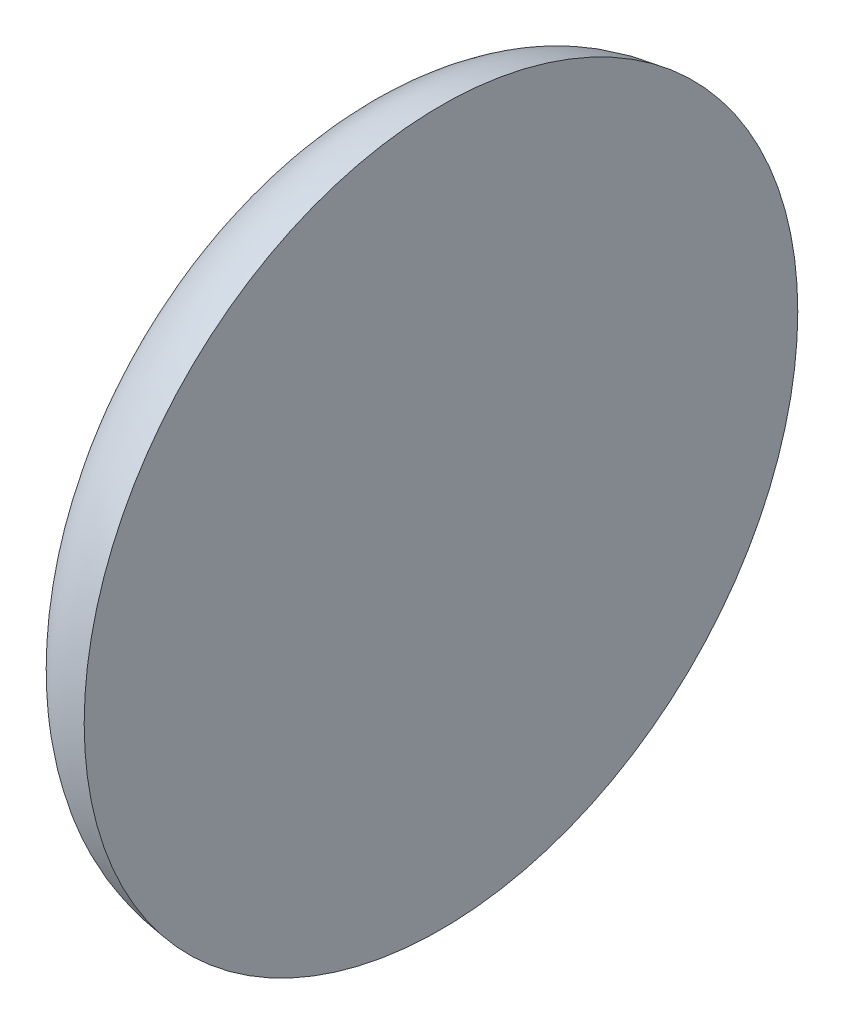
ISO-10303-21;
HEADER;
FILE_DESCRIPTION(('STEP AP214'),'2;1');
FILE_NAME('part.step','',(''),(''),'','','');
FILE_SCHEMA(('AUTOMOTIVE_DESIGN { 1 0 10303 214 1 1 1 1 }'));
ENDSEC;
DATA;
#1=APPLICATION_CONTEXT('core data for automotive mechanical design processes');
#2=APPLICATION_PROTOCOL_DEFINITION('international standard','automotive_design',2000,#1);
#3=PRODUCT_CONTEXT('',#1,'mechanical');
#4=PRODUCT('Part','Part','',(#3));
#5=PRODUCT_RELATED_PRODUCT_CATEGORY('part','',(#4));
#6=PRODUCT_DEFINITION_FORMATION('','',#4);
#7=PRODUCT_DEFINITION_CONTEXT('part definition',#1,'design');
#8=PRODUCT_DEFINITION('design','',#6,#7);
#9=PRODUCT_DEFINITION_SHAPE('','',#8);
#10=(LENGTH_UNIT() NAMED_UNIT(*) SI_UNIT(.MILLI.,.METRE.));
#11=(NAMED_UNIT(*) PLANE_ANGLE_UNIT() SI_UNIT($,.RADIAN.));
#12=(NAMED_UNIT(*) SI_UNIT($,.STERADIAN.) SOLID_ANGLE_UNIT());
#13=UNCERTAINTY_MEASURE_WITH_UNIT(LENGTH_MEASURE(1.E-05),#10,'distance_accuracy_value','');
#14=(GEOMETRIC_REPRESENTATION_CONTEXT(3) GLOBAL_UNCERTAINTY_ASSIGNED_CONTEXT((#13)) GLOBAL_UNIT_ASSIGNED_CONTEXT((#10,
#11,#12)) REPRESENTATION_CONTEXT('',''));
#15=CARTESIAN_POINT('',(0.,0.,0.));
#16=DIRECTION('',(0.,0.,1.));
#17=DIRECTION('',(1.,0.,0.));
#18=AXIS2_PLACEMENT_3D('',#15,#16,#17);
#19=CARTESIAN_POINT('',(5.,0.,-3.));
#20=DIRECTION('',(1.,0.,0.));
#21=DIRECTION('',(0.,0.,-1.));
#22=AXIS2_PLACEMENT_3D('',#19,#20,#21);
#23=PLANE('',#22);
#24=CARTESIAN_POINT('',(5.,0.,0.));
#25=DIRECTION('',(-1.,0.,0.));
#26=DIRECTION('',(0.,0.,1.));
#27=AXIS2_PLACEMENT_3D('',#24,#25,#26);
#28=CIRCLE('',#27,3.);
#29=CARTESIAN_POINT('',(5.,0.,3.));
#30=VERTEX_POINT('',#29);
#31=EDGE_CURVE('E11',#30,#30,#28,.T.);
#32=ORIENTED_EDGE('',*,*,#31,.T.);
#33=EDGE_LOOP('',(#32));
#34=FACE_BOUND('',#33,.T.);
#35=ADVANCED_FACE('F30',(#34),#23,.F.);
#36=CARTESIAN_POINT('',(7.,0.,-6.));
#37=CARTESIAN_POINT('',(6.78088206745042,0.,-5.97176480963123));
#38=CARTESIAN_POINT('',(6.33036741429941,0.,-5.91371220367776));
#39=CARTESIAN_POINT('',(5.83765907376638,0.,-5.51496590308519));
#40=CARTESIAN_POINT('',(5.4581772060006,0.,-4.97345080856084));
#41=CARTESIAN_POINT('',(5.10440247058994,0.,-4.16021298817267));
#42=CARTESIAN_POINT('',(5.03983360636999,0.,-3.44266641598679));
#43=CARTESIAN_POINT('',(5.,0.,-3.));
#44=B_SPLINE_CURVE_WITH_KNOTS('',3,(#36,#37,#38,#39,#40,#41,#42,#43),.UNSPECIFIED.,.F.,.F.,(4,1,
1,1,1,4),(0.,0.164642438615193,0.338511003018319,0.458080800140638,0.665681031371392,1.),.UNSPECIFIED.);
#45=CARTESIAN_POINT('',(0.,0.,0.));
#46=DIRECTION('',(-1.,0.,0.));
#47=AXIS1_PLACEMENT('',#45,#46);
#48=SURFACE_OF_REVOLUTION('',#44,#47);
#49=ORIENTED_EDGE('',*,*,#31,.F.);
#50=EDGE_LOOP('',(#49));
#51=FACE_BOUND('',#50,.T.);
#52=CARTESIAN_POINT('',(7.,0.,0.));
#53=DIRECTION('',(-1.,0.,0.));
#54=DIRECTION('',(0.,0.,1.));
#55=AXIS2_PLACEMENT_3D('',#52,#53,#54);
#56=CIRCLE('',#55,6.);
#57=CARTESIAN_POINT('',(7.,0.,6.));
#58=VERTEX_POINT('',#57);
#59=EDGE_CURVE('E36',#58,#58,#56,.T.);
#60=ORIENTED_EDGE('',*,*,#59,.T.);
#61=EDGE_LOOP('',(#60));
#62=FACE_BOUND('',#61,.T.);
#63=ADVANCED_FACE('F49',(#51,#62),#48,.T.);
#64=CARTESIAN_POINT('',(7.,0.,0.));
#65=DIRECTION('',(-1.,0.,0.));
#66=DIRECTION('',(0.,0.,1.));
#67=AXIS2_PLACEMENT_3D('',#64,#65,#66);
#68=PLANE('',#67);
#69=ORIENTED_EDGE('',*,*,#59,.F.);
#70=EDGE_LOOP('',(#69));
#71=FACE_BOUND('',#70,.T.);
#72=ADVANCED_FACE('F52',(#71),#68,.F.);
#73=CLOSED_SHELL('',(#35,#63,#72));
#74=MANIFOLD_SOLID_BREP('B2',#73);
#75=ADVANCED_BREP_SHAPE_REPRESENTATION('',(#18,#74),#14);
#76=SHAPE_DEFINITION_REPRESENTATION(#9,#75);
ENDSEC;
END-ISO-10303-21;
